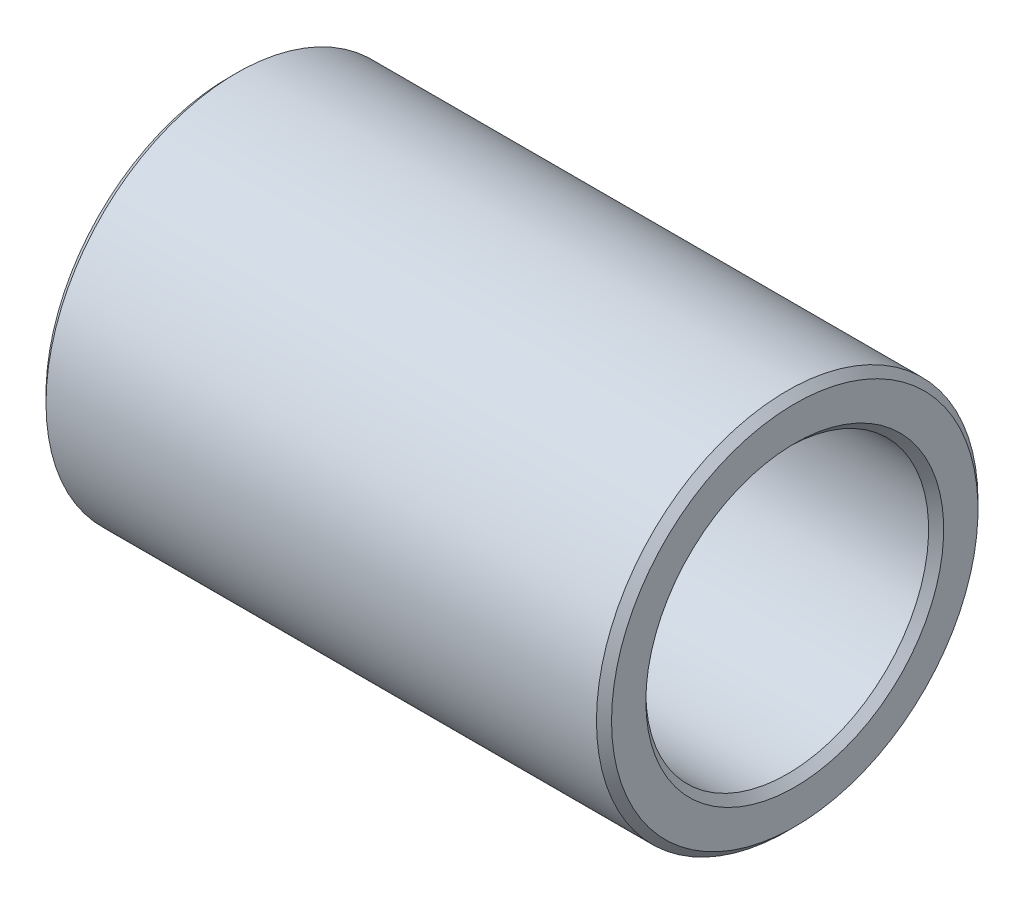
ISO-10303-21;
HEADER;
FILE_DESCRIPTION(('STEP AP214'),'2;1');
FILE_NAME('part.step','',(''),(''),'','','');
FILE_SCHEMA(('AUTOMOTIVE_DESIGN { 1 0 10303 214 1 1 1 1 }'));
ENDSEC;
DATA;
#1=APPLICATION_CONTEXT('core data for automotive mechanical design processes');
#2=APPLICATION_PROTOCOL_DEFINITION('international standard','automotive_design',2000,#1);
#3=PRODUCT_CONTEXT('',#1,'mechanical');
#4=PRODUCT('Part','Part','',(#3));
#5=PRODUCT_RELATED_PRODUCT_CATEGORY('part','',(#4));
#6=PRODUCT_DEFINITION_FORMATION('','',#4);
#7=PRODUCT_DEFINITION_CONTEXT('part definition',#1,'design');
#8=PRODUCT_DEFINITION('design','',#6,#7);
#9=PRODUCT_DEFINITION_SHAPE('','',#8);
#10=(LENGTH_UNIT() NAMED_UNIT(*) SI_UNIT(.MILLI.,.METRE.));
#11=(NAMED_UNIT(*) PLANE_ANGLE_UNIT() SI_UNIT($,.RADIAN.));
#12=(NAMED_UNIT(*) SI_UNIT($,.STERADIAN.) SOLID_ANGLE_UNIT());
#13=UNCERTAINTY_MEASURE_WITH_UNIT(LENGTH_MEASURE(1.E-05),#10,'distance_accuracy_value','');
#14=(GEOMETRIC_REPRESENTATION_CONTEXT(3) GLOBAL_UNCERTAINTY_ASSIGNED_CONTEXT((#13)) GLOBAL_UNIT_ASSIGNED_CONTEXT((#10,
#11,#12)) REPRESENTATION_CONTEXT('',''));
#15=CARTESIAN_POINT('',(0.,0.,0.));
#16=DIRECTION('',(0.,0.,1.));
#17=DIRECTION('',(1.,0.,0.));
#18=AXIS2_PLACEMENT_3D('',#15,#16,#17);
#19=CARTESIAN_POINT('',(-4.7625,3.2131,0.));
#20=DIRECTION('',(1.,0.,0.));
#21=DIRECTION('',(0.,0.,-1.));
#22=AXIS2_PLACEMENT_3D('',#19,#20,#21);
#23=PLANE('',#22);
#24=CARTESIAN_POINT('',(-4.7625,0.,0.));
#25=DIRECTION('',(1.,0.,0.));
#26=DIRECTION('',(0.,0.,-1.));
#27=AXIS2_PLACEMENT_3D('',#24,#25,#26);
#28=CIRCLE('',#27,3.0861);
#29=CARTESIAN_POINT('',(-4.7625,0.,-3.0861));
#30=VERTEX_POINT('',#29);
#31=EDGE_CURVE('E57',#30,#30,#28,.F.);
#32=ORIENTED_EDGE('',*,*,#31,.T.);
#33=EDGE_LOOP('',(#32));
#34=FACE_BOUND('',#33,.T.);
#35=CARTESIAN_POINT('',(-4.7625,0.,0.));
#36=DIRECTION('',(1.,0.,0.));
#37=DIRECTION('',(0.,0.,-1.));
#38=AXIS2_PLACEMENT_3D('',#35,#36,#37);
#39=CIRCLE('',#38,2.50825000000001);
#40=CARTESIAN_POINT('',(-4.7625,0.,-2.50825000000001));
#41=VERTEX_POINT('',#40);
#42=EDGE_CURVE('E60',#41,#41,#39,.T.);
#43=ORIENTED_EDGE('',*,*,#42,.T.);
#44=EDGE_LOOP('',(#43));
#45=FACE_BOUND('',#44,.T.);
#46=ADVANCED_FACE('F31',(#34,#45),#23,.F.);
#47=CARTESIAN_POINT('',(0.,0.,0.));
#48=DIRECTION('',(-1.,0.,0.));
#49=DIRECTION('',(0.,0.,1.));
#50=AXIS2_PLACEMENT_3D('',#47,#48,#49);
#51=CYLINDRICAL_SURFACE('',#50,2.38125);
#52=CARTESIAN_POINT('',(-4.6355,0.,0.));
#53=DIRECTION('',(1.,0.,0.));
#54=DIRECTION('',(0.,0.,-1.));
#55=AXIS2_PLACEMENT_3D('',#52,#53,#54);
#56=CIRCLE('',#55,2.38125);
#57=CARTESIAN_POINT('',(-4.6355,0.,-2.38125));
#58=VERTEX_POINT('',#57);
#59=EDGE_CURVE('E42',#58,#58,#56,.F.);
#60=ORIENTED_EDGE('',*,*,#59,.T.);
#61=EDGE_LOOP('',(#60));
#62=FACE_BOUND('',#61,.T.);
#63=CARTESIAN_POINT('',(4.6355,0.,0.));
#64=DIRECTION('',(-1.,0.,0.));
#65=DIRECTION('',(0.,0.,1.));
#66=AXIS2_PLACEMENT_3D('',#63,#64,#65);
#67=CIRCLE('',#66,2.38125);
#68=CARTESIAN_POINT('',(4.6355,0.,2.38125));
#69=VERTEX_POINT('',#68);
#70=EDGE_CURVE('E46',#69,#69,#67,.F.);
#71=ORIENTED_EDGE('',*,*,#70,.T.);
#72=EDGE_LOOP('',(#71));
#73=FACE_BOUND('',#72,.T.);
#74=ADVANCED_FACE('F73',(#62,#73),#51,.F.);
#75=CARTESIAN_POINT('',(4.7625,3.2131,0.));
#76=DIRECTION('',(-1.,0.,0.));
#77=DIRECTION('',(0.,0.,1.));
#78=AXIS2_PLACEMENT_3D('',#75,#76,#77);
#79=PLANE('',#78);
#80=CARTESIAN_POINT('',(4.7625,0.,0.));
#81=DIRECTION('',(-1.,0.,0.));
#82=DIRECTION('',(0.,0.,1.));
#83=AXIS2_PLACEMENT_3D('',#80,#81,#82);
#84=CIRCLE('',#83,2.50825);
#85=CARTESIAN_POINT('',(4.7625,0.,2.50825));
#86=VERTEX_POINT('',#85);
#87=EDGE_CURVE('E10',#86,#86,#84,.T.);
#88=ORIENTED_EDGE('',*,*,#87,.T.);
#89=EDGE_LOOP('',(#88));
#90=FACE_BOUND('',#89,.T.);
#91=CARTESIAN_POINT('',(4.7625,0.,0.));
#92=DIRECTION('',(-1.,0.,0.));
#93=DIRECTION('',(0.,0.,1.));
#94=AXIS2_PLACEMENT_3D('',#91,#92,#93);
#95=CIRCLE('',#94,3.0861);
#96=CARTESIAN_POINT('',(4.7625,0.,3.0861));
#97=VERTEX_POINT('',#96);
#98=EDGE_CURVE('E38',#97,#97,#95,.F.);
#99=ORIENTED_EDGE('',*,*,#98,.T.);
#100=EDGE_LOOP('',(#99));
#101=FACE_BOUND('',#100,.T.);
#102=ADVANCED_FACE('F76',(#90,#101),#79,.F.);
#103=CARTESIAN_POINT('',(0.,0.,0.));
#104=DIRECTION('',(-1.,0.,0.));
#105=DIRECTION('',(0.,0.,1.));
#106=AXIS2_PLACEMENT_3D('',#103,#104,#105);
#107=CYLINDRICAL_SURFACE('',#106,3.2131);
#108=CARTESIAN_POINT('',(-4.6355,0.,0.));
#109=DIRECTION('',(1.,0.,0.));
#110=DIRECTION('',(0.,0.,-1.));
#111=AXIS2_PLACEMENT_3D('',#108,#109,#110);
#112=CIRCLE('',#111,3.2131);
#113=CARTESIAN_POINT('',(-4.6355,0.,-3.2131));
#114=VERTEX_POINT('',#113);
#115=EDGE_CURVE('E51',#114,#114,#112,.T.);
#116=ORIENTED_EDGE('',*,*,#115,.T.);
#117=EDGE_LOOP('',(#116));
#118=FACE_BOUND('',#117,.T.);
#119=CARTESIAN_POINT('',(4.6355,0.,0.));
#120=DIRECTION('',(-1.,0.,0.));
#121=DIRECTION('',(0.,0.,1.));
#122=AXIS2_PLACEMENT_3D('',#119,#120,#121);
#123=CIRCLE('',#122,3.2131);
#124=CARTESIAN_POINT('',(4.6355,0.,3.2131));
#125=VERTEX_POINT('',#124);
#126=EDGE_CURVE('E54',#125,#125,#123,.T.);
#127=ORIENTED_EDGE('',*,*,#126,.T.);
#128=EDGE_LOOP('',(#127));
#129=FACE_BOUND('',#128,.T.);
#130=ADVANCED_FACE('F94',(#118,#129),#107,.T.);
#131=CARTESIAN_POINT('',(-4.7625,0.,0.));
#132=DIRECTION('',(1.,0.,0.));
#133=DIRECTION('',(0.,0.,-1.));
#134=AXIS2_PLACEMENT_3D('',#131,#132,#133);
#135=CONICAL_SURFACE('',#134,3.0861,0.785398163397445);
#136=ORIENTED_EDGE('',*,*,#115,.F.);
#137=EDGE_LOOP('',(#136));
#138=FACE_BOUND('',#137,.T.);
#139=ORIENTED_EDGE('',*,*,#31,.F.);
#140=EDGE_LOOP('',(#139));
#141=FACE_BOUND('',#140,.T.);
#142=ADVANCED_FACE('F69',(#138,#141),#135,.T.);
#143=CARTESIAN_POINT('',(-4.6355,0.,0.));
#144=DIRECTION('',(-1.,0.,0.));
#145=DIRECTION('',(0.,0.,1.));
#146=AXIS2_PLACEMENT_3D('',#143,#144,#145);
#147=CONICAL_SURFACE('',#146,2.38125,0.785398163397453);
#148=ORIENTED_EDGE('',*,*,#42,.F.);
#149=EDGE_LOOP('',(#148));
#150=FACE_BOUND('',#149,.T.);
#151=ORIENTED_EDGE('',*,*,#59,.F.);
#152=EDGE_LOOP('',(#151));
#153=FACE_BOUND('',#152,.T.);
#154=ADVANCED_FACE('F65',(#150,#153),#147,.F.);
#155=CARTESIAN_POINT('',(4.7625,0.,0.));
#156=DIRECTION('',(1.,0.,0.));
#157=DIRECTION('',(0.,0.,-1.));
#158=AXIS2_PLACEMENT_3D('',#155,#156,#157);
#159=CONICAL_SURFACE('',#158,2.50825,0.785398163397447);
#160=ORIENTED_EDGE('',*,*,#70,.F.);
#161=EDGE_LOOP('',(#160));
#162=FACE_BOUND('',#161,.T.);
#163=ORIENTED_EDGE('',*,*,#87,.F.);
#164=EDGE_LOOP('',(#163));
#165=FACE_BOUND('',#164,.T.);
#166=ADVANCED_FACE('F68',(#162,#165),#159,.F.);
#167=CARTESIAN_POINT('',(4.6355,0.,0.));
#168=DIRECTION('',(-1.,0.,0.));
#169=DIRECTION('',(0.,0.,1.));
#170=AXIS2_PLACEMENT_3D('',#167,#168,#169);
#171=CONICAL_SURFACE('',#170,3.2131,0.785398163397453);
#172=ORIENTED_EDGE('',*,*,#98,.F.);
#173=EDGE_LOOP('',(#172));
#174=FACE_BOUND('',#173,.T.);
#175=ORIENTED_EDGE('',*,*,#126,.F.);
#176=EDGE_LOOP('',(#175));
#177=FACE_BOUND('',#176,.T.);
#178=ADVANCED_FACE('F33',(#174,#177),#171,.T.);
#179=CLOSED_SHELL('',(#46,#74,#102,#130,#142,#154,#166,#178));
#180=MANIFOLD_SOLID_BREP('B2',#179);
#181=ADVANCED_BREP_SHAPE_REPRESENTATION('',(#18,#180),#14);
#182=SHAPE_DEFINITION_REPRESENTATION(#9,#181);
ENDSEC;
END-ISO-10303-21;
